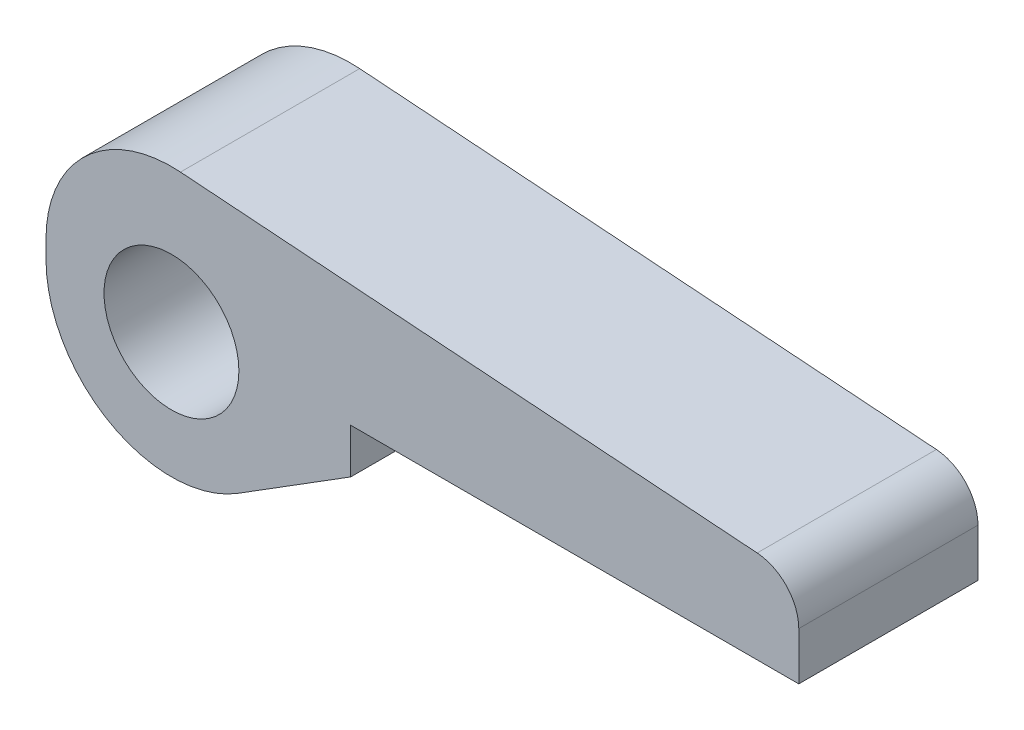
from build123d import *

# Parameters (mm, degrees)
ESQUISSE1_R      = 15.05
EXTRUSION1_DEPTH = 40


with BuildPart() as part:
    # Esquisse1 → Extrusion1 (new body)
    with BuildSketch(Plane.XY):
        with BuildLine():
            Line((40, 0), (40, 2))
            Line((40, 2), (140, 2))
            Line((140, 2), (140, 12.693607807))
            ThreePointArc((140, 12.693607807), (137.320382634, 19.506242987), (130.717600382, 22.667827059))
            Line((130.717600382, 22.667827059), (2.009281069, 31.927813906))
            ThreePointArc((2.009281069, 31.927813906), (-19.075378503, 24.497071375), (-28, 4))
            Line((-28, 4), (-28, 0))
            ThreePointArc((-28, 0), (-13.566892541, -24.493660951), (14.852816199, -23.735919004))
            Line((14.852816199, -23.735919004), (40, -8))
            Line((40, -8), (40, 0))
        make_face()
        Circle(ESQUISSE1_R, mode=Mode.SUBTRACT)
    extrude(amount=EXTRUSION1_DEPTH)


solid = part.part
